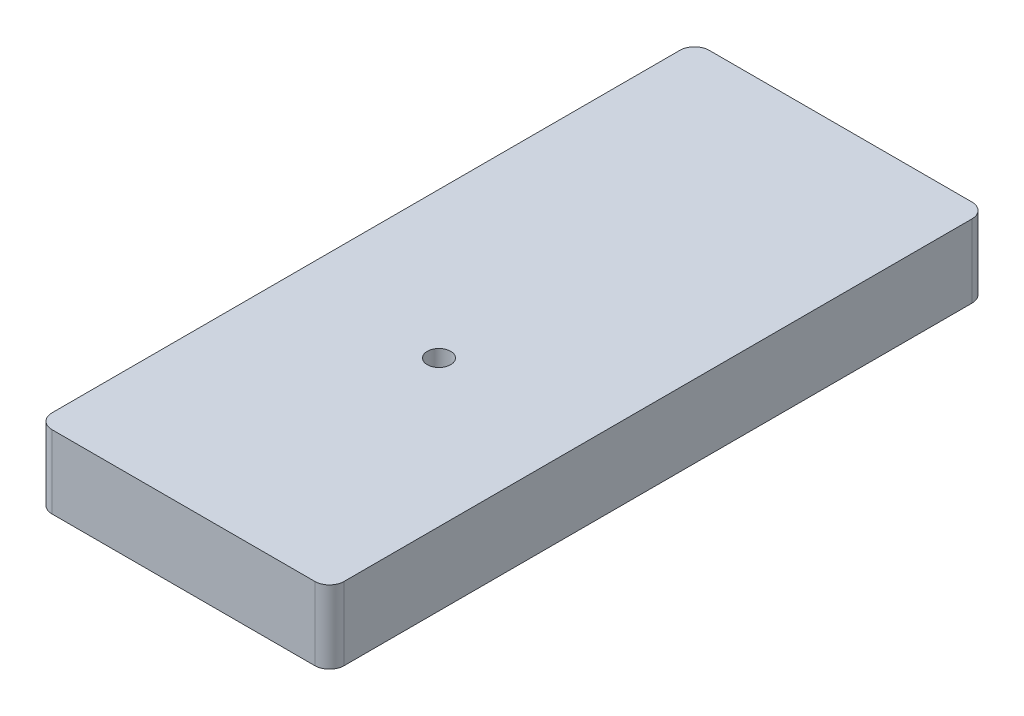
from build123d import *

# Parameters (mm, degrees)
ESQUISSE1_R             = 1.6
EXTRUSION1_DEPTH        = 10
ESQUISSE2_R             = 1.1
ENL_V_MAT_EXTRU_1_DEPTH = 4


with BuildPart() as part:
    # Esquisse1 → Extrusion1 (new body)
    with BuildSketch(Plane(origin=(0, 0, 0), x_dir=(1, 0, 0), z_dir=(0, 1, 0))):
        with BuildLine():
            Line((13, 2), (13, 88))
            ThreePointArc((13, 88), (13.585786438, 89.414213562), (15, 90))
            Line((15, 90), (51, 90))
            ThreePointArc((51, 90), (52.414213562, 89.414213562), (53, 88))
            Line((53, 88), (53, 2))
            ThreePointArc((53, 2), (52.414213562, 0.585786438), (51, 0))
            Line((51, 0), (15, 0))
            ThreePointArc((15, 0), (13.585786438, 0.585786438), (13, 2))
        make_face()
        with Locations(Location((33, 35, 0), (0, 0, 270))):
            Circle(ESQUISSE1_R, mode=Mode.SUBTRACT)
    extrude(amount=EXTRUSION1_DEPTH)

    # Esquisse2 → Enl_v. mat.-Extru.1 (cut)
    with BuildSketch(Plane.XZ):
        with Locations(Location((21, -7, 0), (0, 0, 90))):
            Circle(ESQUISSE2_R)
        with Locations(Location((21, -23, 0), (0, 0, 90))):
            Circle(ESQUISSE2_R)
        with BuildLine():
            Line((41, -82.7372583), (41, -81.2627417))
            ThreePointArc((41, -81.2627417), (41, -79), (38.7372583, -79))
            Line((38.7372583, -79), (27.2627417, -79))
            ThreePointArc((27.2627417, -79), (25, -79), (25, -81.2627417))
            Line((25, -81.2627417), (25, -82.7372583))
            ThreePointArc((25, -82.7372583), (25, -85), (27.2627417, -85))
            Line((27.2627417, -85), (38.7372583, -85))
            ThreePointArc((38.7372583, -85), (41, -85), (41, -82.7372583))
        make_face()
        with BuildLine():
            Line((45.7372583, -49.5), (44.2627417, -49.5))
            ThreePointArc((44.2627417, -49.5), (42, -49.5), (42, -51.7627417))
            Line((42, -51.7627417), (42, -67.2372583))
            ThreePointArc((42, -67.2372583), (42, -69.5), (44.2627417, -69.5))
            Line((44.2627417, -69.5), (45.7372583, -69.5))
            ThreePointArc((45.7372583, -69.5), (48, -69.5), (48, -67.2372583))
            Line((48, -67.2372583), (48, -51.7627417))
            ThreePointArc((48, -51.7627417), (48, -49.5), (45.7372583, -49.5))
        make_face()
        with BuildLine():
            Line((24, -67.2372583), (24, -51.7627417))
            ThreePointArc((24, -51.7627417), (24, -49.5), (21.7372583, -49.5))
            Line((21.7372583, -49.5), (20.2627417, -49.5))
            ThreePointArc((20.2627417, -49.5), (18, -49.5), (18, -51.7627417))
            Line((18, -51.7627417), (18, -67.2372583))
            ThreePointArc((18, -67.2372583), (18, -69.5), (20.2627417, -69.5))
            Line((20.2627417, -69.5), (21.7372583, -69.5))
            ThreePointArc((21.7372583, -69.5), (24, -69.5), (24, -67.2372583))
        make_face()
    extrude(amount=-ENL_V_MAT_EXTRU_1_DEPTH, mode=Mode.SUBTRACT)


solid = part.part
